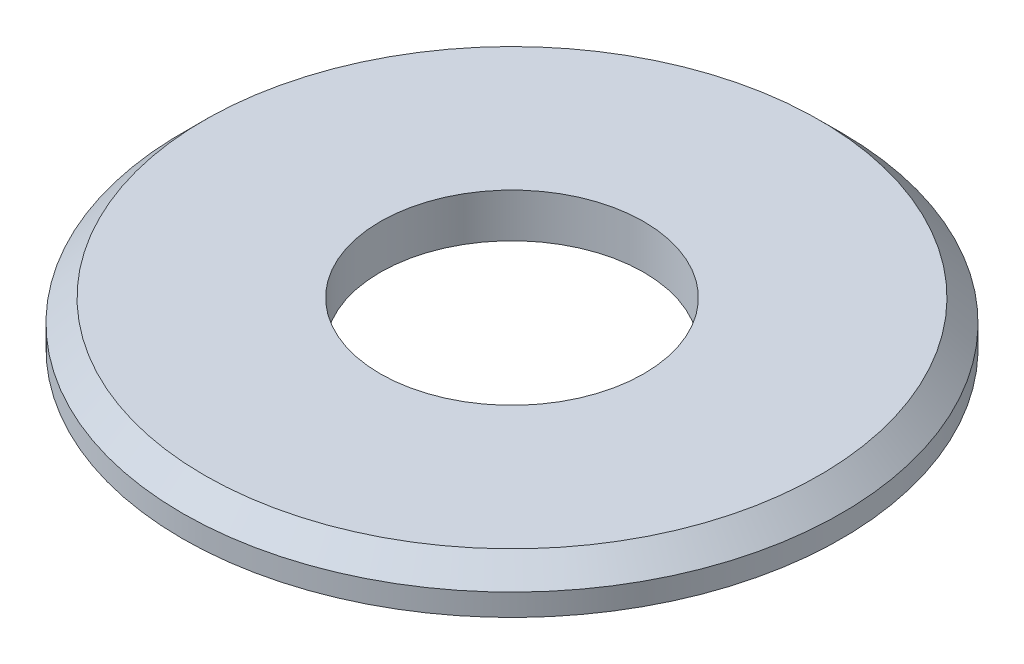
from build123d import *

# Parameters (mm, degrees)
SKETCH1_R      = 2.25
SKETCH1_R_2    = 0.9
EXTRUDE1_DEPTH = 0.3
CHAMFER1_SIZE  = 0.15


with BuildPart() as part:
    # Sketch1 → Extrude1 (new body)
    with BuildSketch(Plane(origin=(0, 0, 0), x_dir=(1, 0, 0), z_dir=(0, 1, 0))):
        with Locations(Location((0, 0, 0), (0, 0, 270))):
            Circle(SKETCH1_R)
        with Locations(Location((0, 0, 0), (0, 0, 270))):
            Circle(SKETCH1_R_2, mode=Mode.SUBTRACT)
    extrude(amount=EXTRUDE1_DEPTH)

    # Chamfer1
    chamfer1_edges = [part.edges().sort_by_distance(p)[0] for p in [
        (0, 0.3, -2.25),
    ]]
    chamfer(chamfer1_edges, length=CHAMFER1_SIZE)


solid = part.part
